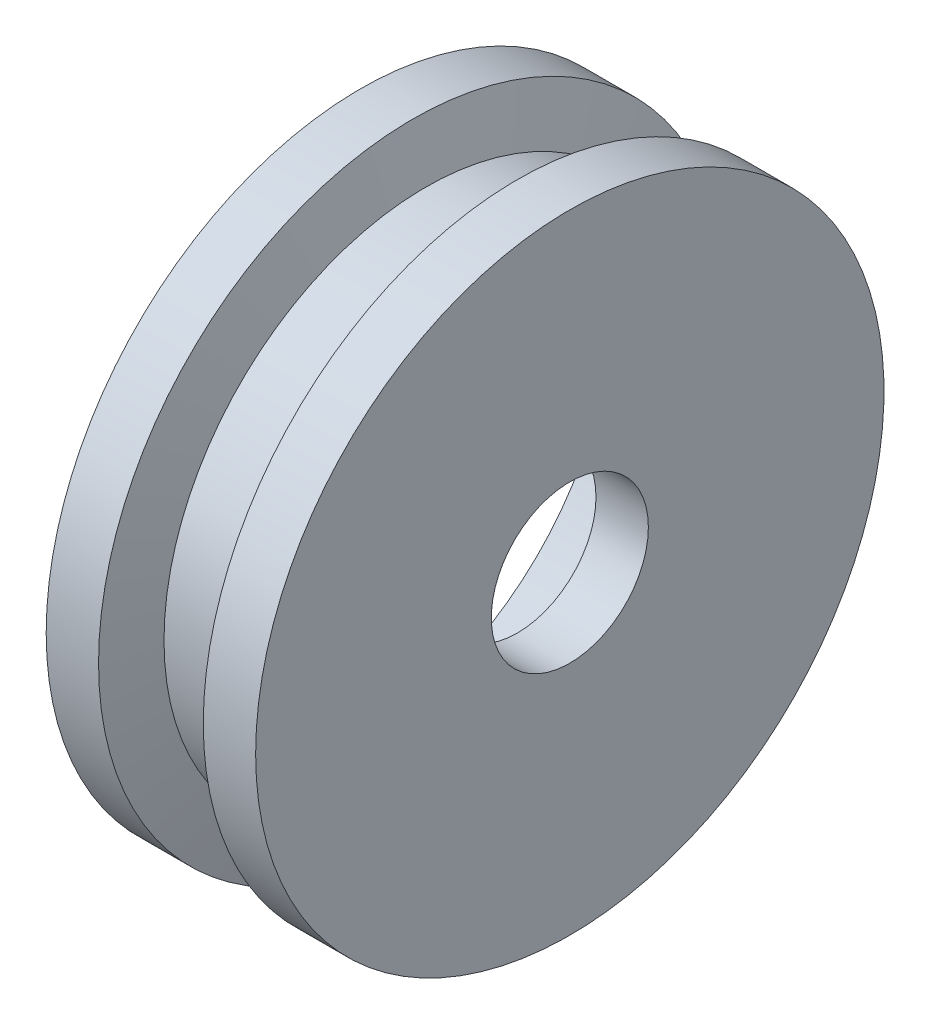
ISO-10303-21;
HEADER;
FILE_DESCRIPTION(('STEP AP214'),'2;1');
FILE_NAME('part.step','',(''),(''),'','','');
FILE_SCHEMA(('AUTOMOTIVE_DESIGN { 1 0 10303 214 1 1 1 1 }'));
ENDSEC;
DATA;
#1=APPLICATION_CONTEXT('core data for automotive mechanical design processes');
#2=APPLICATION_PROTOCOL_DEFINITION('international standard','automotive_design',2000,#1);
#3=PRODUCT_CONTEXT('',#1,'mechanical');
#4=PRODUCT('Part','Part','',(#3));
#5=PRODUCT_RELATED_PRODUCT_CATEGORY('part','',(#4));
#6=PRODUCT_DEFINITION_FORMATION('','',#4);
#7=PRODUCT_DEFINITION_CONTEXT('part definition',#1,'design');
#8=PRODUCT_DEFINITION('design','',#6,#7);
#9=PRODUCT_DEFINITION_SHAPE('','',#8);
#10=(LENGTH_UNIT() NAMED_UNIT(*) SI_UNIT(.MILLI.,.METRE.));
#11=(NAMED_UNIT(*) PLANE_ANGLE_UNIT() SI_UNIT($,.RADIAN.));
#12=(NAMED_UNIT(*) SI_UNIT($,.STERADIAN.) SOLID_ANGLE_UNIT());
#13=UNCERTAINTY_MEASURE_WITH_UNIT(LENGTH_MEASURE(1.E-05),#10,'distance_accuracy_value','');
#14=(GEOMETRIC_REPRESENTATION_CONTEXT(3) GLOBAL_UNCERTAINTY_ASSIGNED_CONTEXT((#13)) GLOBAL_UNIT_ASSIGNED_CONTEXT((#10,
#11,#12)) REPRESENTATION_CONTEXT('',''));
#15=CARTESIAN_POINT('',(0.,0.,0.));
#16=DIRECTION('',(0.,0.,1.));
#17=DIRECTION('',(1.,0.,0.));
#18=AXIS2_PLACEMENT_3D('',#15,#16,#17);
#19=CARTESIAN_POINT('',(-4.,0.,0.));
#20=DIRECTION('',(1.,0.,0.));
#21=DIRECTION('',(0.,0.,-1.));
#22=AXIS2_PLACEMENT_3D('',#19,#20,#21);
#23=PLANE('',#22);
#24=CARTESIAN_POINT('',(-4.,0.,0.));
#25=DIRECTION('',(-1.,0.,0.));
#26=DIRECTION('',(0.,0.,1.));
#27=AXIS2_PLACEMENT_3D('',#24,#25,#26);
#28=CIRCLE('',#27,9.6);
#29=CARTESIAN_POINT('',(-4.,0.,9.6));
#30=VERTEX_POINT('',#29);
#31=EDGE_CURVE('E60',#30,#30,#28,.T.);
#32=ORIENTED_EDGE('',*,*,#31,.F.);
#33=EDGE_LOOP('',(#32));
#34=FACE_BOUND('',#33,.T.);
#35=CARTESIAN_POINT('',(-4.,0.,0.));
#36=DIRECTION('',(-1.,0.,0.));
#37=DIRECTION('',(0.,0.,1.));
#38=AXIS2_PLACEMENT_3D('',#35,#36,#37);
#39=CIRCLE('',#38,12.);
#40=CARTESIAN_POINT('',(-4.,0.,12.));
#41=VERTEX_POINT('',#40);
#42=EDGE_CURVE('E10',#41,#41,#39,.T.);
#43=ORIENTED_EDGE('',*,*,#42,.T.);
#44=EDGE_LOOP('',(#43));
#45=FACE_BOUND('',#44,.T.);
#46=ADVANCED_FACE('F34',(#34,#45),#23,.F.);
#47=CARTESIAN_POINT('',(-12.9632642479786,0.,0.));
#48=DIRECTION('',(-1.,0.,0.));
#49=DIRECTION('',(0.,0.,1.));
#50=AXIS2_PLACEMENT_3D('',#47,#48,#49);
#51=CYLINDRICAL_SURFACE('',#50,12.);
#52=ORIENTED_EDGE('',*,*,#42,.F.);
#53=EDGE_LOOP('',(#52));
#54=FACE_BOUND('',#53,.T.);
#55=CARTESIAN_POINT('',(-2.,0.,0.));
#56=DIRECTION('',(-1.,0.,0.));
#57=DIRECTION('',(0.,0.,1.));
#58=AXIS2_PLACEMENT_3D('',#55,#56,#57);
#59=CIRCLE('',#58,12.);
#60=CARTESIAN_POINT('',(-2.,0.,12.));
#61=VERTEX_POINT('',#60);
#62=EDGE_CURVE('E41',#61,#61,#59,.T.);
#63=ORIENTED_EDGE('',*,*,#62,.T.);
#64=EDGE_LOOP('',(#63));
#65=FACE_BOUND('',#64,.T.);
#66=ADVANCED_FACE('F88',(#54,#65),#51,.T.);
#67=CARTESIAN_POINT('',(-1.5,0.,0.));
#68=DIRECTION('',(-1.,0.,0.));
#69=DIRECTION('',(0.,0.,1.));
#70=AXIS2_PLACEMENT_3D('',#67,#68,#69);
#71=CONICAL_SURFACE('',#70,10.,1.32581766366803);
#72=ORIENTED_EDGE('',*,*,#62,.F.);
#73=EDGE_LOOP('',(#72));
#74=FACE_BOUND('',#73,.T.);
#75=CARTESIAN_POINT('',(-1.5,0.,0.));
#76=DIRECTION('',(-1.,0.,0.));
#77=DIRECTION('',(0.,0.,1.));
#78=AXIS2_PLACEMENT_3D('',#75,#76,#77);
#79=CIRCLE('',#78,10.);
#80=CARTESIAN_POINT('',(-1.5,0.,10.));
#81=VERTEX_POINT('',#80);
#82=EDGE_CURVE('E45',#81,#81,#79,.T.);
#83=ORIENTED_EDGE('',*,*,#82,.T.);
#84=EDGE_LOOP('',(#83));
#85=FACE_BOUND('',#84,.T.);
#86=ADVANCED_FACE('F92',(#74,#85),#71,.T.);
#87=CARTESIAN_POINT('',(-12.9632642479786,0.,0.));
#88=DIRECTION('',(-1.,0.,0.));
#89=DIRECTION('',(0.,0.,1.));
#90=AXIS2_PLACEMENT_3D('',#87,#88,#89);
#91=CYLINDRICAL_SURFACE('',#90,10.);
#92=ORIENTED_EDGE('',*,*,#82,.F.);
#93=EDGE_LOOP('',(#92));
#94=FACE_BOUND('',#93,.T.);
#95=CARTESIAN_POINT('',(1.5,0.,0.));
#96=DIRECTION('',(-1.,0.,0.));
#97=DIRECTION('',(0.,0.,1.));
#98=AXIS2_PLACEMENT_3D('',#95,#96,#97);
#99=CIRCLE('',#98,10.);
#100=CARTESIAN_POINT('',(1.5,0.,10.));
#101=VERTEX_POINT('',#100);
#102=EDGE_CURVE('E50',#101,#101,#99,.T.);
#103=ORIENTED_EDGE('',*,*,#102,.T.);
#104=EDGE_LOOP('',(#103));
#105=FACE_BOUND('',#104,.T.);
#106=ADVANCED_FACE('F97',(#94,#105),#91,.T.);
#107=CARTESIAN_POINT('',(2.,0.,0.));
#108=DIRECTION('',(1.,0.,0.));
#109=DIRECTION('',(0.,0.,-1.));
#110=AXIS2_PLACEMENT_3D('',#107,#108,#109);
#111=CONICAL_SURFACE('',#110,12.,1.32581766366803);
#112=ORIENTED_EDGE('',*,*,#102,.F.);
#113=EDGE_LOOP('',(#112));
#114=FACE_BOUND('',#113,.T.);
#115=CARTESIAN_POINT('',(2.,0.,0.));
#116=DIRECTION('',(-1.,0.,0.));
#117=DIRECTION('',(0.,0.,1.));
#118=AXIS2_PLACEMENT_3D('',#115,#116,#117);
#119=CIRCLE('',#118,12.);
#120=CARTESIAN_POINT('',(2.,0.,12.));
#121=VERTEX_POINT('',#120);
#122=EDGE_CURVE('E53',#121,#121,#119,.T.);
#123=ORIENTED_EDGE('',*,*,#122,.T.);
#124=EDGE_LOOP('',(#123));
#125=FACE_BOUND('',#124,.T.);
#126=ADVANCED_FACE('F104',(#114,#125),#111,.T.);
#127=CARTESIAN_POINT('',(-12.9632642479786,0.,0.));
#128=DIRECTION('',(-1.,0.,0.));
#129=DIRECTION('',(0.,0.,1.));
#130=AXIS2_PLACEMENT_3D('',#127,#128,#129);
#131=CYLINDRICAL_SURFACE('',#130,12.);
#132=ORIENTED_EDGE('',*,*,#122,.F.);
#133=EDGE_LOOP('',(#132));
#134=FACE_BOUND('',#133,.T.);
#135=CARTESIAN_POINT('',(4.,0.,0.));
#136=DIRECTION('',(-1.,0.,0.));
#137=DIRECTION('',(0.,0.,1.));
#138=AXIS2_PLACEMENT_3D('',#135,#136,#137);
#139=CIRCLE('',#138,12.);
#140=CARTESIAN_POINT('',(4.,0.,12.));
#141=VERTEX_POINT('',#140);
#142=EDGE_CURVE('E56',#141,#141,#139,.T.);
#143=ORIENTED_EDGE('',*,*,#142,.T.);
#144=EDGE_LOOP('',(#143));
#145=FACE_BOUND('',#144,.T.);
#146=ADVANCED_FACE('F108',(#134,#145),#131,.T.);
#147=CARTESIAN_POINT('',(4.,0.,0.));
#148=DIRECTION('',(-1.,0.,0.));
#149=DIRECTION('',(0.,0.,1.));
#150=AXIS2_PLACEMENT_3D('',#147,#148,#149);
#151=PLANE('',#150);
#152=CARTESIAN_POINT('',(4.,0.,0.));
#153=DIRECTION('',(1.,0.,0.));
#154=DIRECTION('',(0.,0.,-1.));
#155=AXIS2_PLACEMENT_3D('',#152,#153,#154);
#156=CIRCLE('',#155,3.);
#157=CARTESIAN_POINT('',(4.,0.,-3.));
#158=VERTEX_POINT('',#157);
#159=EDGE_CURVE('E65',#158,#158,#156,.T.);
#160=ORIENTED_EDGE('',*,*,#159,.F.);
#161=EDGE_LOOP('',(#160));
#162=FACE_BOUND('',#161,.T.);
#163=ORIENTED_EDGE('',*,*,#142,.F.);
#164=EDGE_LOOP('',(#163));
#165=FACE_BOUND('',#164,.T.);
#166=ADVANCED_FACE('F83',(#162,#165),#151,.F.);
#167=CARTESIAN_POINT('',(2.,0.,0.));
#168=DIRECTION('',(-1.,0.,0.));
#169=DIRECTION('',(0.,0.,1.));
#170=AXIS2_PLACEMENT_3D('',#167,#168,#169);
#171=CYLINDRICAL_SURFACE('',#170,9.6);
#172=CARTESIAN_POINT('',(2.,0.,0.));
#173=DIRECTION('',(-1.,0.,0.));
#174=DIRECTION('',(0.,0.,1.));
#175=AXIS2_PLACEMENT_3D('',#172,#173,#174);
#176=CIRCLE('',#175,9.6);
#177=CARTESIAN_POINT('',(2.,0.,9.6));
#178=VERTEX_POINT('',#177);
#179=EDGE_CURVE('E59',#178,#178,#176,.T.);
#180=ORIENTED_EDGE('',*,*,#179,.F.);
#181=EDGE_LOOP('',(#180));
#182=FACE_BOUND('',#181,.T.);
#183=ORIENTED_EDGE('',*,*,#31,.T.);
#184=EDGE_LOOP('',(#183));
#185=FACE_BOUND('',#184,.T.);
#186=ADVANCED_FACE('F77',(#182,#185),#171,.F.);
#187=CARTESIAN_POINT('',(2.,0.,0.));
#188=DIRECTION('',(-1.,0.,0.));
#189=DIRECTION('',(0.,0.,1.));
#190=AXIS2_PLACEMENT_3D('',#187,#188,#189);
#191=PLANE('',#190);
#192=CARTESIAN_POINT('',(2.,0.,0.));
#193=DIRECTION('',(-1.,0.,0.));
#194=DIRECTION('',(0.,0.,1.));
#195=AXIS2_PLACEMENT_3D('',#192,#193,#194);
#196=CIRCLE('',#195,3.);
#197=CARTESIAN_POINT('',(2.,0.,3.));
#198=VERTEX_POINT('',#197);
#199=EDGE_CURVE('E37',#198,#198,#196,.T.);
#200=ORIENTED_EDGE('',*,*,#199,.F.);
#201=EDGE_LOOP('',(#200));
#202=FACE_BOUND('',#201,.T.);
#203=ORIENTED_EDGE('',*,*,#179,.T.);
#204=EDGE_LOOP('',(#203));
#205=FACE_BOUND('',#204,.T.);
#206=ADVANCED_FACE('F74',(#202,#205),#191,.T.);
#207=CARTESIAN_POINT('',(-4.,0.,0.));
#208=DIRECTION('',(1.,0.,0.));
#209=DIRECTION('',(0.,0.,-1.));
#210=AXIS2_PLACEMENT_3D('',#207,#208,#209);
#211=CYLINDRICAL_SURFACE('',#210,3.);
#212=ORIENTED_EDGE('',*,*,#199,.T.);
#213=EDGE_LOOP('',(#212));
#214=FACE_BOUND('',#213,.T.);
#215=ORIENTED_EDGE('',*,*,#159,.T.);
#216=EDGE_LOOP('',(#215));
#217=FACE_BOUND('',#216,.T.);
#218=ADVANCED_FACE('F72',(#214,#217),#211,.F.);
#219=CLOSED_SHELL('',(#46,#66,#86,#106,#126,#146,#166,#186,#206,#218));
#220=MANIFOLD_SOLID_BREP('B2',#219);
#221=ADVANCED_BREP_SHAPE_REPRESENTATION('',(#18,#220),#14);
#222=SHAPE_DEFINITION_REPRESENTATION(#9,#221);
ENDSEC;
END-ISO-10303-21;
